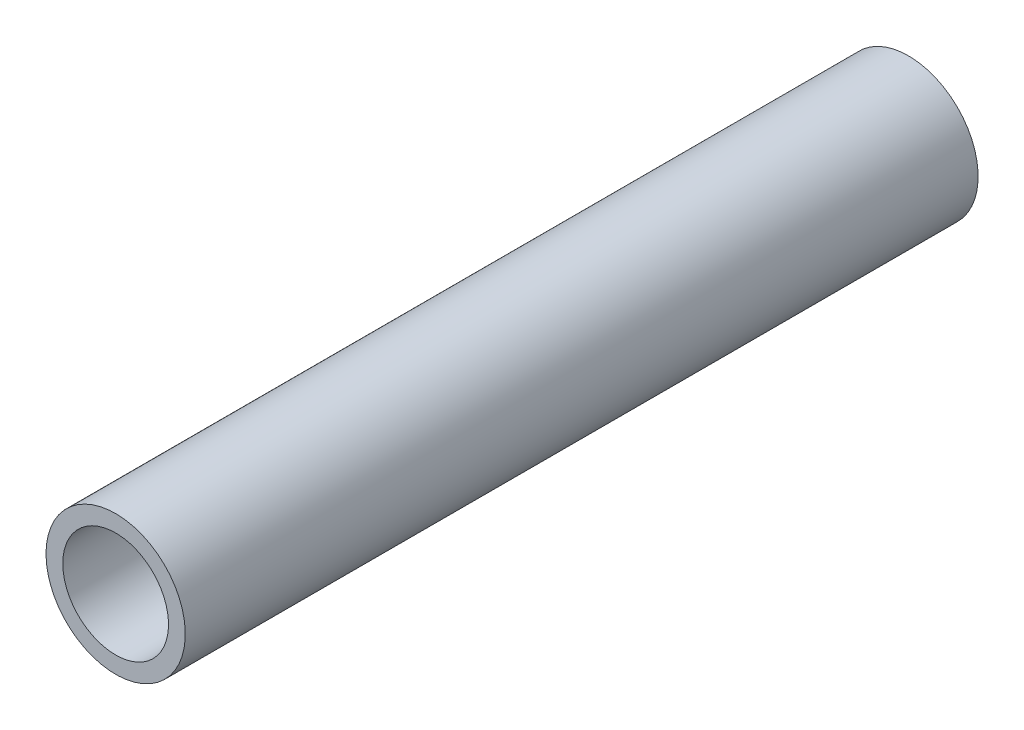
ISO-10303-21;
HEADER;
FILE_DESCRIPTION(('STEP AP214'),'2;1');
FILE_NAME('part.step','',(''),(''),'','','');
FILE_SCHEMA(('AUTOMOTIVE_DESIGN { 1 0 10303 214 1 1 1 1 }'));
ENDSEC;
DATA;
#1=APPLICATION_CONTEXT('core data for automotive mechanical design processes');
#2=APPLICATION_PROTOCOL_DEFINITION('international standard','automotive_design',2000,#1);
#3=PRODUCT_CONTEXT('',#1,'mechanical');
#4=PRODUCT('Part','Part','',(#3));
#5=PRODUCT_RELATED_PRODUCT_CATEGORY('part','',(#4));
#6=PRODUCT_DEFINITION_FORMATION('','',#4);
#7=PRODUCT_DEFINITION_CONTEXT('part definition',#1,'design');
#8=PRODUCT_DEFINITION('design','',#6,#7);
#9=PRODUCT_DEFINITION_SHAPE('','',#8);
#10=(LENGTH_UNIT() NAMED_UNIT(*) SI_UNIT(.MILLI.,.METRE.));
#11=(NAMED_UNIT(*) PLANE_ANGLE_UNIT() SI_UNIT($,.RADIAN.));
#12=(NAMED_UNIT(*) SI_UNIT($,.STERADIAN.) SOLID_ANGLE_UNIT());
#13=UNCERTAINTY_MEASURE_WITH_UNIT(LENGTH_MEASURE(1.E-05),#10,'distance_accuracy_value','');
#14=(GEOMETRIC_REPRESENTATION_CONTEXT(3) GLOBAL_UNCERTAINTY_ASSIGNED_CONTEXT((#13)) GLOBAL_UNIT_ASSIGNED_CONTEXT((#10,
#11,#12)) REPRESENTATION_CONTEXT('',''));
#15=CARTESIAN_POINT('',(0.,0.,0.));
#16=DIRECTION('',(0.,0.,1.));
#17=DIRECTION('',(1.,0.,0.));
#18=AXIS2_PLACEMENT_3D('',#15,#16,#17);
#19=CARTESIAN_POINT('',(0.,0.,0.));
#20=DIRECTION('',(0.,0.,1.));
#21=DIRECTION('',(1.,0.,0.));
#22=AXIS2_PLACEMENT_3D('',#19,#20,#21);
#23=PLANE('',#22);
#24=CARTESIAN_POINT('',(0.,0.,0.));
#25=DIRECTION('',(0.,0.,-1.));
#26=DIRECTION('',(1.,0.,0.));
#27=AXIS2_PLACEMENT_3D('',#24,#25,#26);
#28=CIRCLE('',#27,0.8001);
#29=CARTESIAN_POINT('',(-0.8001,0.,0.));
#30=VERTEX_POINT('',#29);
#31=EDGE_CURVE('E56',#30,#30,#28,.T.);
#32=ORIENTED_EDGE('',*,*,#31,.F.);
#33=EDGE_LOOP('',(#32));
#34=FACE_BOUND('',#33,.T.);
#35=CARTESIAN_POINT('',(0.,0.,0.));
#36=DIRECTION('',(0.,0.,1.));
#37=DIRECTION('',(1.,0.,0.));
#38=AXIS2_PLACEMENT_3D('',#35,#36,#37);
#39=CIRCLE('',#38,1.0541);
#40=CARTESIAN_POINT('',(-1.0541,0.,0.));
#41=VERTEX_POINT('',#40);
#42=EDGE_CURVE('E11',#41,#41,#39,.T.);
#43=ORIENTED_EDGE('',*,*,#42,.F.);
#44=EDGE_LOOP('',(#43));
#45=FACE_BOUND('',#44,.T.);
#46=ADVANCED_FACE('F16',(#34,#45),#23,.F.);
#47=CARTESIAN_POINT('',(0.,0.,12.));
#48=DIRECTION('',(0.,0.,1.));
#49=DIRECTION('',(1.,0.,0.));
#50=AXIS2_PLACEMENT_3D('',#47,#48,#49);
#51=PLANE('',#50);
#52=CARTESIAN_POINT('',(0.,0.,12.));
#53=DIRECTION('',(0.,0.,-1.));
#54=DIRECTION('',(1.,0.,0.));
#55=AXIS2_PLACEMENT_3D('',#52,#53,#54);
#56=CIRCLE('',#55,0.8001);
#57=CARTESIAN_POINT('',(-0.8001,0.,12.));
#58=VERTEX_POINT('',#57);
#59=EDGE_CURVE('E54',#58,#58,#56,.T.);
#60=ORIENTED_EDGE('',*,*,#59,.T.);
#61=EDGE_LOOP('',(#60));
#62=FACE_BOUND('',#61,.T.);
#63=CARTESIAN_POINT('',(0.,0.,12.));
#64=DIRECTION('',(0.,0.,1.));
#65=DIRECTION('',(1.,0.,0.));
#66=AXIS2_PLACEMENT_3D('',#63,#64,#65);
#67=CIRCLE('',#66,1.0541);
#68=CARTESIAN_POINT('',(-1.0541,0.,12.));
#69=VERTEX_POINT('',#68);
#70=EDGE_CURVE('E70',#69,#69,#67,.T.);
#71=ORIENTED_EDGE('',*,*,#70,.T.);
#72=EDGE_LOOP('',(#71));
#73=FACE_BOUND('',#72,.T.);
#74=ADVANCED_FACE('F60',(#62,#73),#51,.T.);
#75=CARTESIAN_POINT('',(0.,0.,0.));
#76=DIRECTION('',(0.,0.,1.));
#77=DIRECTION('',(1.,0.,0.));
#78=AXIS2_PLACEMENT_3D('',#75,#76,#77);
#79=CYLINDRICAL_SURFACE('',#78,1.0541);
#80=ORIENTED_EDGE('',*,*,#70,.F.);
#81=DIRECTION('',(0.,0.,-1.));
#82=VECTOR('',#81,1.);
#83=CARTESIAN_POINT('',(-1.0541,0.,0.));
#84=LINE('',#83,#82);
#85=EDGE_CURVE('E24',#69,#41,#84,.T.);
#86=ORIENTED_EDGE('',*,*,#85,.T.);
#87=ORIENTED_EDGE('',*,*,#42,.T.);
#88=ORIENTED_EDGE('',*,*,#85,.F.);
#89=EDGE_LOOP('',(#80,#86,#87,#88));
#90=FACE_BOUND('',#89,.T.);
#91=ADVANCED_FACE('F75',(#90),#79,.T.);
#92=CARTESIAN_POINT('',(0.,0.,0.));
#93=DIRECTION('',(0.,0.,1.));
#94=DIRECTION('',(1.,0.,0.));
#95=AXIS2_PLACEMENT_3D('',#92,#93,#94);
#96=CYLINDRICAL_SURFACE('',#95,0.8001);
#97=ORIENTED_EDGE('',*,*,#59,.F.);
#98=DIRECTION('',(0.,0.,-1.));
#99=VECTOR('',#98,1.);
#100=CARTESIAN_POINT('',(-0.8001,0.,0.));
#101=LINE('',#100,#99);
#102=EDGE_CURVE('E51',#58,#30,#101,.T.);
#103=ORIENTED_EDGE('',*,*,#102,.T.);
#104=ORIENTED_EDGE('',*,*,#31,.T.);
#105=ORIENTED_EDGE('',*,*,#102,.F.);
#106=EDGE_LOOP('',(#97,#103,#104,#105));
#107=FACE_BOUND('',#106,.T.);
#108=ADVANCED_FACE('F53',(#107),#96,.F.);
#109=CLOSED_SHELL('',(#46,#74,#91,#108));
#110=MANIFOLD_SOLID_BREP('B1',#109);
#111=ADVANCED_BREP_SHAPE_REPRESENTATION('',(#18,#110),#14);
#112=SHAPE_DEFINITION_REPRESENTATION(#9,#111);
ENDSEC;
END-ISO-10303-21;
